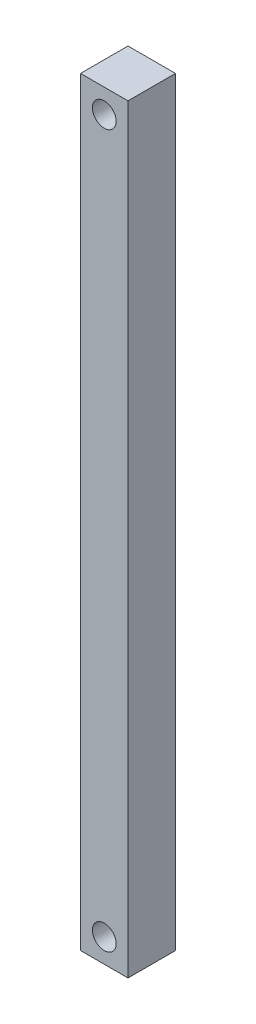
ISO-10303-21;
HEADER;
FILE_DESCRIPTION(('STEP AP214'),'2;1');
FILE_NAME('part.step','',(''),(''),'','','');
FILE_SCHEMA(('AUTOMOTIVE_DESIGN { 1 0 10303 214 1 1 1 1 }'));
ENDSEC;
DATA;
#1=APPLICATION_CONTEXT('core data for automotive mechanical design processes');
#2=APPLICATION_PROTOCOL_DEFINITION('international standard','automotive_design',2000,#1);
#3=PRODUCT_CONTEXT('',#1,'mechanical');
#4=PRODUCT('Part','Part','',(#3));
#5=PRODUCT_RELATED_PRODUCT_CATEGORY('part','',(#4));
#6=PRODUCT_DEFINITION_FORMATION('','',#4);
#7=PRODUCT_DEFINITION_CONTEXT('part definition',#1,'design');
#8=PRODUCT_DEFINITION('design','',#6,#7);
#9=PRODUCT_DEFINITION_SHAPE('','',#8);
#10=(LENGTH_UNIT() NAMED_UNIT(*) SI_UNIT(.MILLI.,.METRE.));
#11=(NAMED_UNIT(*) PLANE_ANGLE_UNIT() SI_UNIT($,.RADIAN.));
#12=(NAMED_UNIT(*) SI_UNIT($,.STERADIAN.) SOLID_ANGLE_UNIT());
#13=UNCERTAINTY_MEASURE_WITH_UNIT(LENGTH_MEASURE(1.E-05),#10,'distance_accuracy_value','');
#14=(GEOMETRIC_REPRESENTATION_CONTEXT(3) GLOBAL_UNCERTAINTY_ASSIGNED_CONTEXT((#13)) GLOBAL_UNIT_ASSIGNED_CONTEXT((#10,
#11,#12)) REPRESENTATION_CONTEXT('',''));
#15=CARTESIAN_POINT('',(0.,0.,0.));
#16=DIRECTION('',(0.,0.,1.));
#17=DIRECTION('',(1.,0.,0.));
#18=AXIS2_PLACEMENT_3D('',#15,#16,#17);
#19=CARTESIAN_POINT('',(0.,0.,-5.));
#20=DIRECTION('',(0.,0.,-1.));
#21=DIRECTION('',(-1.,0.,0.));
#22=AXIS2_PLACEMENT_3D('',#19,#20,#21);
#23=PLANE('',#22);
#24=DIRECTION('',(1.,0.,0.));
#25=VECTOR('',#24,1.);
#26=CARTESIAN_POINT('',(-5.,40.,-5.));
#27=LINE('',#26,#25);
#28=CARTESIAN_POINT('',(-5.,40.,-5.));
#29=VERTEX_POINT('',#28);
#30=CARTESIAN_POINT('',(5.,40.,-5.));
#31=VERTEX_POINT('',#30);
#32=EDGE_CURVE('E82',#29,#31,#27,.T.);
#33=ORIENTED_EDGE('',*,*,#32,.T.);
#34=DIRECTION('',(0.,-1.,0.));
#35=VECTOR('',#34,1.);
#36=CARTESIAN_POINT('',(5.,40.,-5.));
#37=LINE('',#36,#35);
#38=CARTESIAN_POINT('',(5.,-120.,-5.));
#39=VERTEX_POINT('',#38);
#40=EDGE_CURVE('E55',#31,#39,#37,.T.);
#41=ORIENTED_EDGE('',*,*,#40,.T.);
#42=DIRECTION('',(1.,0.,0.));
#43=VECTOR('',#42,1.);
#44=CARTESIAN_POINT('',(-5.,-120.,-5.));
#45=LINE('',#44,#43);
#46=CARTESIAN_POINT('',(-5.,-120.,-5.));
#47=VERTEX_POINT('',#46);
#48=EDGE_CURVE('E98',#47,#39,#45,.T.);
#49=ORIENTED_EDGE('',*,*,#48,.F.);
#50=DIRECTION('',(0.,-1.,0.));
#51=VECTOR('',#50,1.);
#52=CARTESIAN_POINT('',(-5.,40.,-5.));
#53=LINE('',#52,#51);
#54=EDGE_CURVE('E89',#29,#47,#53,.T.);
#55=ORIENTED_EDGE('',*,*,#54,.F.);
#56=EDGE_LOOP('',(#33,#41,#49,#55));
#57=FACE_BOUND('',#56,.T.);
#58=CARTESIAN_POINT('',(0.,35.,-5.));
#59=DIRECTION('',(0.,0.,1.));
#60=DIRECTION('',(1.,0.,0.));
#61=AXIS2_PLACEMENT_3D('',#58,#59,#60);
#62=CIRCLE('',#61,2.5);
#63=CARTESIAN_POINT('',(2.5,35.,-5.));
#64=VERTEX_POINT('',#63);
#65=EDGE_CURVE('E108',#64,#64,#62,.T.);
#66=ORIENTED_EDGE('',*,*,#65,.T.);
#67=EDGE_LOOP('',(#66));
#68=FACE_BOUND('',#67,.T.);
#69=CARTESIAN_POINT('',(0.,-115.,-5.));
#70=DIRECTION('',(0.,0.,-1.));
#71=DIRECTION('',(1.,0.,0.));
#72=AXIS2_PLACEMENT_3D('',#69,#70,#71);
#73=CIRCLE('',#72,2.5);
#74=CARTESIAN_POINT('',(2.5,-115.,-5.));
#75=VERTEX_POINT('',#74);
#76=EDGE_CURVE('E99',#75,#75,#73,.T.);
#77=ORIENTED_EDGE('',*,*,#76,.F.);
#78=EDGE_LOOP('',(#77));
#79=FACE_BOUND('',#78,.T.);
#80=ADVANCED_FACE('F34',(#57,#68,#79),#23,.T.);
#81=CARTESIAN_POINT('',(0.,0.,5.));
#82=DIRECTION('',(0.,0.,-1.));
#83=DIRECTION('',(-1.,0.,0.));
#84=AXIS2_PLACEMENT_3D('',#81,#82,#83);
#85=PLANE('',#84);
#86=DIRECTION('',(1.,0.,0.));
#87=VECTOR('',#86,1.);
#88=CARTESIAN_POINT('',(-5.,40.,5.));
#89=LINE('',#88,#87);
#90=CARTESIAN_POINT('',(-5.,40.,5.));
#91=VERTEX_POINT('',#90);
#92=CARTESIAN_POINT('',(5.,40.,5.));
#93=VERTEX_POINT('',#92);
#94=EDGE_CURVE('E81',#91,#93,#89,.T.);
#95=ORIENTED_EDGE('',*,*,#94,.F.);
#96=DIRECTION('',(0.,-1.,0.));
#97=VECTOR('',#96,1.);
#98=CARTESIAN_POINT('',(-5.,40.,5.));
#99=LINE('',#98,#97);
#100=CARTESIAN_POINT('',(-5.,-120.,5.));
#101=VERTEX_POINT('',#100);
#102=EDGE_CURVE('E73',#91,#101,#99,.T.);
#103=ORIENTED_EDGE('',*,*,#102,.T.);
#104=DIRECTION('',(1.,0.,0.));
#105=VECTOR('',#104,1.);
#106=CARTESIAN_POINT('',(-5.,-120.,5.));
#107=LINE('',#106,#105);
#108=CARTESIAN_POINT('',(5.,-120.,5.));
#109=VERTEX_POINT('',#108);
#110=EDGE_CURVE('E79',#101,#109,#107,.T.);
#111=ORIENTED_EDGE('',*,*,#110,.T.);
#112=DIRECTION('',(0.,-1.,0.));
#113=VECTOR('',#112,1.);
#114=CARTESIAN_POINT('',(5.,40.,5.));
#115=LINE('',#114,#113);
#116=EDGE_CURVE('E83',#93,#109,#115,.T.);
#117=ORIENTED_EDGE('',*,*,#116,.F.);
#118=EDGE_LOOP('',(#95,#103,#111,#117));
#119=FACE_BOUND('',#118,.T.);
#120=CARTESIAN_POINT('',(0.,35.,5.));
#121=DIRECTION('',(0.,0.,1.));
#122=DIRECTION('',(1.,0.,0.));
#123=AXIS2_PLACEMENT_3D('',#120,#121,#122);
#124=CIRCLE('',#123,2.5);
#125=CARTESIAN_POINT('',(2.5,35.,5.));
#126=VERTEX_POINT('',#125);
#127=EDGE_CURVE('E93',#126,#126,#124,.T.);
#128=ORIENTED_EDGE('',*,*,#127,.F.);
#129=EDGE_LOOP('',(#128));
#130=FACE_BOUND('',#129,.T.);
#131=CARTESIAN_POINT('',(0.,-115.,5.));
#132=DIRECTION('',(0.,0.,-1.));
#133=DIRECTION('',(1.,0.,0.));
#134=AXIS2_PLACEMENT_3D('',#131,#132,#133);
#135=CIRCLE('',#134,2.5);
#136=CARTESIAN_POINT('',(2.5,-115.,5.));
#137=VERTEX_POINT('',#136);
#138=EDGE_CURVE('E103',#137,#137,#135,.T.);
#139=ORIENTED_EDGE('',*,*,#138,.T.);
#140=EDGE_LOOP('',(#139));
#141=FACE_BOUND('',#140,.T.);
#142=ADVANCED_FACE('F75',(#119,#130,#141),#85,.F.);
#143=CARTESIAN_POINT('',(-5.,40.,-5.));
#144=DIRECTION('',(0.,-1.,0.));
#145=DIRECTION('',(0.,0.,-1.));
#146=AXIS2_PLACEMENT_3D('',#143,#144,#145);
#147=PLANE('',#146);
#148=DIRECTION('',(0.,0.,1.));
#149=VECTOR('',#148,1.);
#150=CARTESIAN_POINT('',(-5.,40.,-5.));
#151=LINE('',#150,#149);
#152=EDGE_CURVE('E42',#29,#91,#151,.T.);
#153=ORIENTED_EDGE('',*,*,#152,.T.);
#154=ORIENTED_EDGE('',*,*,#94,.T.);
#155=DIRECTION('',(0.,0.,1.));
#156=VECTOR('',#155,1.);
#157=CARTESIAN_POINT('',(5.,40.,-5.));
#158=LINE('',#157,#156);
#159=EDGE_CURVE('E11',#31,#93,#158,.T.);
#160=ORIENTED_EDGE('',*,*,#159,.F.);
#161=ORIENTED_EDGE('',*,*,#32,.F.);
#162=EDGE_LOOP('',(#153,#154,#160,#161));
#163=FACE_BOUND('',#162,.T.);
#164=ADVANCED_FACE('F36',(#163),#147,.F.);
#165=CARTESIAN_POINT('',(5.,40.,-5.));
#166=DIRECTION('',(-1.,0.,0.));
#167=DIRECTION('',(0.,0.,1.));
#168=AXIS2_PLACEMENT_3D('',#165,#166,#167);
#169=PLANE('',#168);
#170=ORIENTED_EDGE('',*,*,#159,.T.);
#171=ORIENTED_EDGE('',*,*,#116,.T.);
#172=DIRECTION('',(0.,0.,1.));
#173=VECTOR('',#172,1.);
#174=CARTESIAN_POINT('',(5.,-120.,-5.));
#175=LINE('',#174,#173);
#176=EDGE_CURVE('E94',#39,#109,#175,.T.);
#177=ORIENTED_EDGE('',*,*,#176,.F.);
#178=ORIENTED_EDGE('',*,*,#40,.F.);
#179=EDGE_LOOP('',(#170,#171,#177,#178));
#180=FACE_BOUND('',#179,.T.);
#181=ADVANCED_FACE('F121',(#180),#169,.F.);
#182=CARTESIAN_POINT('',(-5.,40.,-5.));
#183=DIRECTION('',(-1.,0.,0.));
#184=DIRECTION('',(0.,0.,1.));
#185=AXIS2_PLACEMENT_3D('',#182,#183,#184);
#186=PLANE('',#185);
#187=ORIENTED_EDGE('',*,*,#54,.T.);
#188=DIRECTION('',(0.,0.,1.));
#189=VECTOR('',#188,1.);
#190=CARTESIAN_POINT('',(-5.,-120.,-5.));
#191=LINE('',#190,#189);
#192=EDGE_CURVE('E86',#47,#101,#191,.T.);
#193=ORIENTED_EDGE('',*,*,#192,.T.);
#194=ORIENTED_EDGE('',*,*,#102,.F.);
#195=ORIENTED_EDGE('',*,*,#152,.F.);
#196=EDGE_LOOP('',(#187,#193,#194,#195));
#197=FACE_BOUND('',#196,.T.);
#198=ADVANCED_FACE('F87',(#197),#186,.T.);
#199=CARTESIAN_POINT('',(0.,35.,-5.));
#200=DIRECTION('',(0.,0.,1.));
#201=DIRECTION('',(1.,0.,0.));
#202=AXIS2_PLACEMENT_3D('',#199,#200,#201);
#203=CYLINDRICAL_SURFACE('',#202,2.5);
#204=ORIENTED_EDGE('',*,*,#65,.F.);
#205=EDGE_LOOP('',(#204));
#206=FACE_BOUND('',#205,.T.);
#207=ORIENTED_EDGE('',*,*,#127,.T.);
#208=EDGE_LOOP('',(#207));
#209=FACE_BOUND('',#208,.T.);
#210=ADVANCED_FACE('F127',(#206,#209),#203,.F.);
#211=CARTESIAN_POINT('',(-5.,-120.,-5.));
#212=DIRECTION('',(0.,-1.,0.));
#213=DIRECTION('',(0.,0.,-1.));
#214=AXIS2_PLACEMENT_3D('',#211,#212,#213);
#215=PLANE('',#214);
#216=ORIENTED_EDGE('',*,*,#176,.T.);
#217=ORIENTED_EDGE('',*,*,#110,.F.);
#218=ORIENTED_EDGE('',*,*,#192,.F.);
#219=ORIENTED_EDGE('',*,*,#48,.T.);
#220=EDGE_LOOP('',(#216,#217,#218,#219));
#221=FACE_BOUND('',#220,.T.);
#222=ADVANCED_FACE('F97',(#221),#215,.T.);
#223=CARTESIAN_POINT('',(0.,-115.,-5.));
#224=DIRECTION('',(0.,0.,1.));
#225=DIRECTION('',(1.,0.,0.));
#226=AXIS2_PLACEMENT_3D('',#223,#224,#225);
#227=CYLINDRICAL_SURFACE('',#226,2.5);
#228=ORIENTED_EDGE('',*,*,#76,.T.);
#229=EDGE_LOOP('',(#228));
#230=FACE_BOUND('',#229,.T.);
#231=ORIENTED_EDGE('',*,*,#138,.F.);
#232=EDGE_LOOP('',(#231));
#233=FACE_BOUND('',#232,.T.);
#234=ADVANCED_FACE('F141',(#230,#233),#227,.F.);
#235=CLOSED_SHELL('',(#80,#142,#164,#181,#198,#210,#222,#234));
#236=MANIFOLD_SOLID_BREP('B2',#235);
#237=ADVANCED_BREP_SHAPE_REPRESENTATION('',(#18,#236),#14);
#238=SHAPE_DEFINITION_REPRESENTATION(#9,#237);
ENDSEC;
END-ISO-10303-21;
